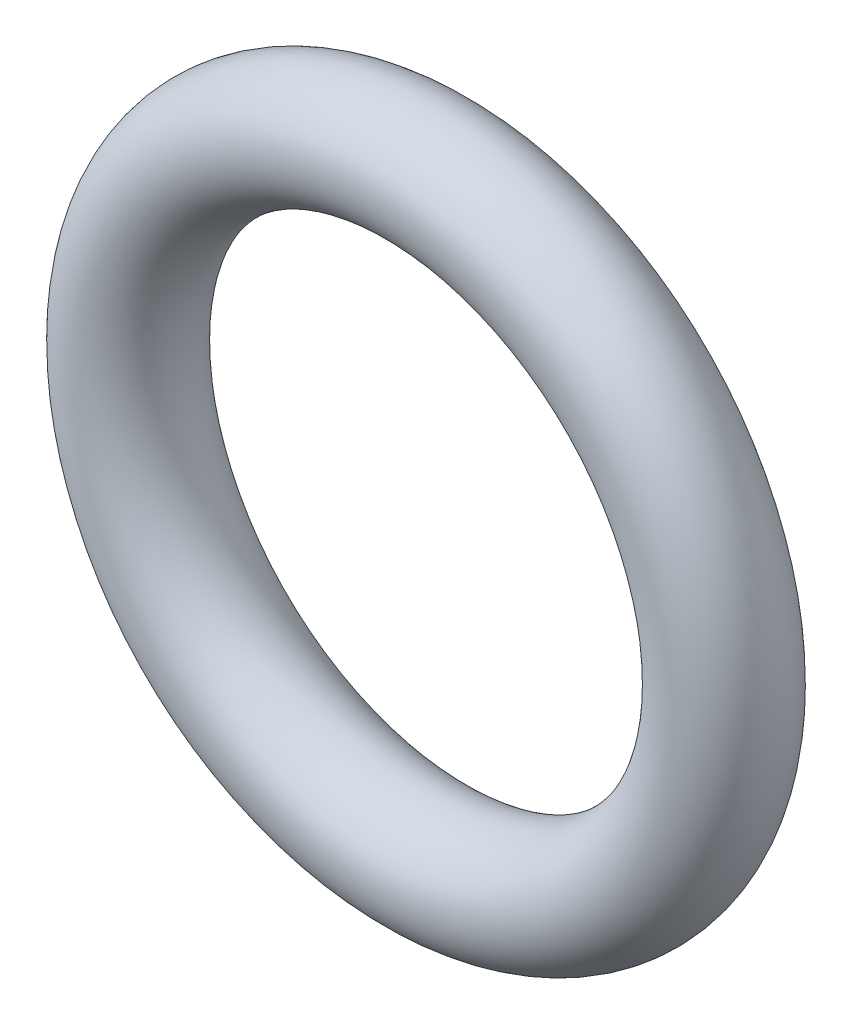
ISO-10303-21;
HEADER;
FILE_DESCRIPTION(('STEP AP214'),'2;1');
FILE_NAME('part.step','',(''),(''),'','','');
FILE_SCHEMA(('AUTOMOTIVE_DESIGN { 1 0 10303 214 1 1 1 1 }'));
ENDSEC;
DATA;
#1=APPLICATION_CONTEXT('core data for automotive mechanical design processes');
#2=APPLICATION_PROTOCOL_DEFINITION('international standard','automotive_design',2000,#1);
#3=PRODUCT_CONTEXT('',#1,'mechanical');
#4=PRODUCT('Part','Part','',(#3));
#5=PRODUCT_RELATED_PRODUCT_CATEGORY('part','',(#4));
#6=PRODUCT_DEFINITION_FORMATION('','',#4);
#7=PRODUCT_DEFINITION_CONTEXT('part definition',#1,'design');
#8=PRODUCT_DEFINITION('design','',#6,#7);
#9=PRODUCT_DEFINITION_SHAPE('','',#8);
#10=(LENGTH_UNIT() NAMED_UNIT(*) SI_UNIT(.MILLI.,.METRE.));
#11=(NAMED_UNIT(*) PLANE_ANGLE_UNIT() SI_UNIT($,.RADIAN.));
#12=(NAMED_UNIT(*) SI_UNIT($,.STERADIAN.) SOLID_ANGLE_UNIT());
#13=UNCERTAINTY_MEASURE_WITH_UNIT(LENGTH_MEASURE(1.E-05),#10,'distance_accuracy_value','');
#14=(GEOMETRIC_REPRESENTATION_CONTEXT(3) GLOBAL_UNCERTAINTY_ASSIGNED_CONTEXT((#13)) GLOBAL_UNIT_ASSIGNED_CONTEXT((#10,
#11,#12)) REPRESENTATION_CONTEXT('',''));
#15=CARTESIAN_POINT('',(0.,0.,0.));
#16=DIRECTION('',(0.,0.,1.));
#17=DIRECTION('',(1.,0.,0.));
#18=AXIS2_PLACEMENT_3D('',#15,#16,#17);
#19=CARTESIAN_POINT('',(0.,0.,0.));
#20=DIRECTION('',(0.,0.,-1.));
#21=DIRECTION('',(-1.,0.,0.));
#22=AXIS2_PLACEMENT_3D('',#19,#20,#21);
#23=TOROIDAL_SURFACE('',#22,4.65,0.9);
#24=CARTESIAN_POINT('',(-5.55,0.,0.));
#25=VERTEX_POINT('',#24);
#26=VERTEX_LOOP('',#25);
#27=FACE_BOUND('',#26,.T.);
#28=ADVANCED_FACE('F35',(#27),#23,.T.);
#29=CLOSED_SHELL('',(#28));
#30=MANIFOLD_SOLID_BREP('B2',#29);
#31=ADVANCED_BREP_SHAPE_REPRESENTATION('',(#18,#30),#14);
#32=SHAPE_DEFINITION_REPRESENTATION(#9,#31);
ENDSEC;
END-ISO-10303-21;
